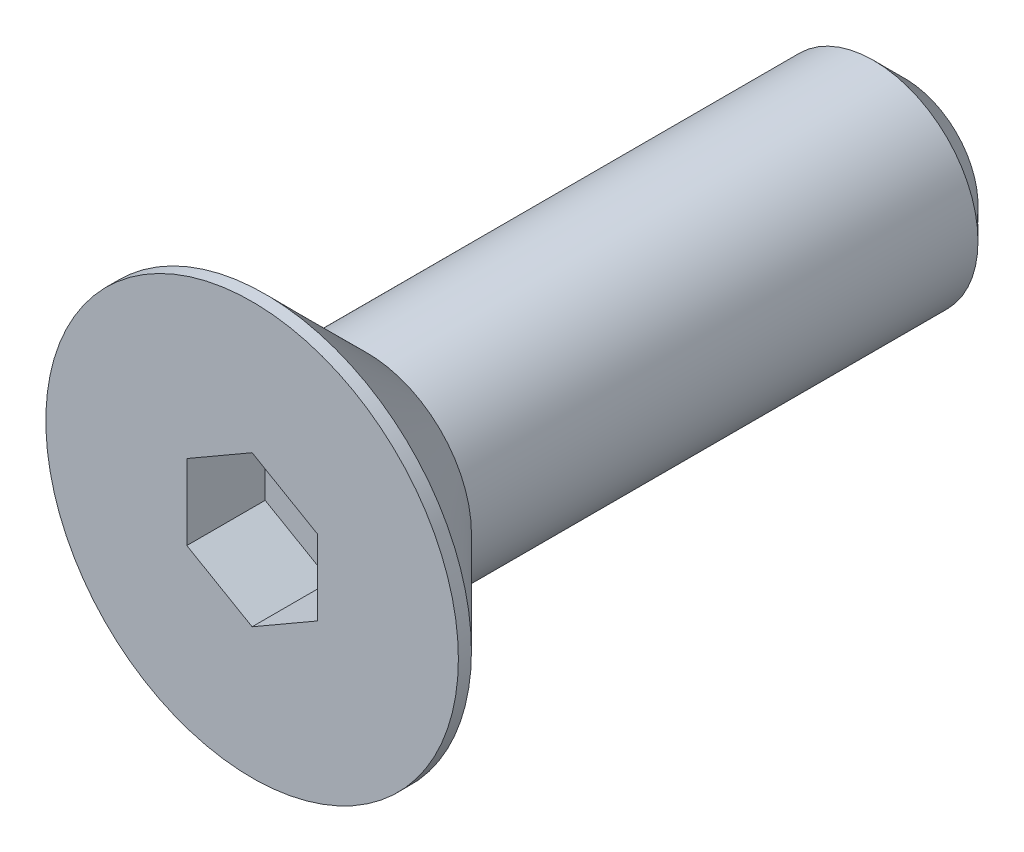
ISO-10303-21;
HEADER;
FILE_DESCRIPTION(('STEP AP214'),'2;1');
FILE_NAME('part.step','',(''),(''),'','','');
FILE_SCHEMA(('AUTOMOTIVE_DESIGN { 1 0 10303 214 1 1 1 1 }'));
ENDSEC;
DATA;
#1=APPLICATION_CONTEXT('core data for automotive mechanical design processes');
#2=APPLICATION_PROTOCOL_DEFINITION('international standard','automotive_design',2000,#1);
#3=PRODUCT_CONTEXT('',#1,'mechanical');
#4=PRODUCT('Part','Part','',(#3));
#5=PRODUCT_RELATED_PRODUCT_CATEGORY('part','',(#4));
#6=PRODUCT_DEFINITION_FORMATION('','',#4);
#7=PRODUCT_DEFINITION_CONTEXT('part definition',#1,'design');
#8=PRODUCT_DEFINITION('design','',#6,#7);
#9=PRODUCT_DEFINITION_SHAPE('','',#8);
#10=(LENGTH_UNIT() NAMED_UNIT(*) SI_UNIT(.MILLI.,.METRE.));
#11=(NAMED_UNIT(*) PLANE_ANGLE_UNIT() SI_UNIT($,.RADIAN.));
#12=(NAMED_UNIT(*) SI_UNIT($,.STERADIAN.) SOLID_ANGLE_UNIT());
#13=UNCERTAINTY_MEASURE_WITH_UNIT(LENGTH_MEASURE(1.E-05),#10,'distance_accuracy_value','');
#14=(GEOMETRIC_REPRESENTATION_CONTEXT(3) GLOBAL_UNCERTAINTY_ASSIGNED_CONTEXT((#13)) GLOBAL_UNIT_ASSIGNED_CONTEXT((#10,
#11,#12)) REPRESENTATION_CONTEXT('',''));
#15=CARTESIAN_POINT('',(0.,0.,0.));
#16=DIRECTION('',(0.,0.,1.));
#17=DIRECTION('',(1.,0.,0.));
#18=AXIS2_PLACEMENT_3D('',#15,#16,#17);
#19=CARTESIAN_POINT('',(0.,0.,0.));
#20=DIRECTION('',(0.,0.,1.));
#21=DIRECTION('',(1.,0.,0.));
#22=AXIS2_PLACEMENT_3D('',#19,#20,#21);
#23=PLANE('',#22);
#24=DIRECTION('',(-0.866025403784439,0.5,0.));
#25=VECTOR('',#24,1.);
#26=CARTESIAN_POINT('',(2.5,1.44337567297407,0.));
#27=LINE('',#26,#25);
#28=CARTESIAN_POINT('',(2.5,1.44337567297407,0.));
#29=VERTEX_POINT('',#28);
#30=CARTESIAN_POINT('',(0.,2.88675134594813,0.));
#31=VERTEX_POINT('',#30);
#32=EDGE_CURVE('E29',#29,#31,#27,.T.);
#33=ORIENTED_EDGE('',*,*,#32,.F.);
#34=DIRECTION('',(0.,1.,0.));
#35=VECTOR('',#34,1.);
#36=CARTESIAN_POINT('',(2.5,-1.44337567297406,0.));
#37=LINE('',#36,#35);
#38=CARTESIAN_POINT('',(2.5,-1.44337567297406,0.));
#39=VERTEX_POINT('',#38);
#40=EDGE_CURVE('E112',#39,#29,#37,.T.);
#41=ORIENTED_EDGE('',*,*,#40,.F.);
#42=DIRECTION('',(0.866025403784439,0.5,0.));
#43=VECTOR('',#42,1.);
#44=CARTESIAN_POINT('',(0.,-2.88675134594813,0.));
#45=LINE('',#44,#43);
#46=CARTESIAN_POINT('',(0.,-2.88675134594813,0.));
#47=VERTEX_POINT('',#46);
#48=EDGE_CURVE('E110',#47,#39,#45,.T.);
#49=ORIENTED_EDGE('',*,*,#48,.F.);
#50=DIRECTION('',(0.866025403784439,-0.5,0.));
#51=VECTOR('',#50,1.);
#52=CARTESIAN_POINT('',(-2.5,-1.44337567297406,0.));
#53=LINE('',#52,#51);
#54=CARTESIAN_POINT('',(-2.5,-1.44337567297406,0.));
#55=VERTEX_POINT('',#54);
#56=EDGE_CURVE('E77',#55,#47,#53,.T.);
#57=ORIENTED_EDGE('',*,*,#56,.F.);
#58=DIRECTION('',(0.,-1.,0.));
#59=VECTOR('',#58,1.);
#60=CARTESIAN_POINT('',(-2.5,1.44337567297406,0.));
#61=LINE('',#60,#59);
#62=CARTESIAN_POINT('',(-2.5,1.44337567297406,0.));
#63=VERTEX_POINT('',#62);
#64=EDGE_CURVE('E106',#63,#55,#61,.T.);
#65=ORIENTED_EDGE('',*,*,#64,.F.);
#66=DIRECTION('',(-0.866025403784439,-0.5,0.));
#67=VECTOR('',#66,1.);
#68=CARTESIAN_POINT('',(0.,2.88675134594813,0.));
#69=LINE('',#68,#67);
#70=EDGE_CURVE('E103',#31,#63,#69,.T.);
#71=ORIENTED_EDGE('',*,*,#70,.F.);
#72=EDGE_LOOP('',(#33,#41,#49,#57,#65,#71));
#73=FACE_BOUND('',#72,.T.);
#74=CARTESIAN_POINT('',(0.,0.,0.));
#75=DIRECTION('',(0.,0.,1.));
#76=DIRECTION('',(1.,0.,0.));
#77=AXIS2_PLACEMENT_3D('',#74,#75,#76);
#78=CIRCLE('',#77,7.9);
#79=CARTESIAN_POINT('',(7.9,0.,0.));
#80=VERTEX_POINT('',#79);
#81=EDGE_CURVE('E127',#80,#80,#78,.T.);
#82=ORIENTED_EDGE('',*,*,#81,.T.);
#83=EDGE_LOOP('',(#82));
#84=FACE_BOUND('',#83,.T.);
#85=ADVANCED_FACE('F14',(#73,#84),#23,.T.);
#86=CARTESIAN_POINT('',(0.,0.,0.));
#87=DIRECTION('',(0.,0.,1.));
#88=DIRECTION('',(1.,0.,0.));
#89=AXIS2_PLACEMENT_3D('',#86,#87,#88);
#90=CYLINDRICAL_SURFACE('',#89,7.9);
#91=CARTESIAN_POINT('',(0.,0.,-0.499999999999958));
#92=DIRECTION('',(0.,0.,1.));
#93=DIRECTION('',(1.,0.,0.));
#94=AXIS2_PLACEMENT_3D('',#91,#92,#93);
#95=CIRCLE('',#94,7.9);
#96=CARTESIAN_POINT('',(7.9,0.,-0.499999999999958));
#97=VERTEX_POINT('',#96);
#98=EDGE_CURVE('E124',#97,#97,#95,.T.);
#99=ORIENTED_EDGE('',*,*,#98,.T.);
#100=EDGE_LOOP('',(#99));
#101=FACE_BOUND('',#100,.T.);
#102=ORIENTED_EDGE('',*,*,#81,.F.);
#103=EDGE_LOOP('',(#102));
#104=FACE_BOUND('',#103,.T.);
#105=ADVANCED_FACE('F151',(#101,#104),#90,.T.);
#106=CARTESIAN_POINT('',(0.,0.,-0.499999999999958));
#107=DIRECTION('',(0.,0.,1.));
#108=DIRECTION('',(1.,0.,0.));
#109=AXIS2_PLACEMENT_3D('',#106,#107,#108);
#110=CONICAL_SURFACE('',#109,7.9,0.785398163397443);
#111=CARTESIAN_POINT('',(0.,0.,-4.4));
#112=DIRECTION('',(0.,0.,1.));
#113=DIRECTION('',(1.,0.,0.));
#114=AXIS2_PLACEMENT_3D('',#111,#112,#113);
#115=CIRCLE('',#114,4.);
#116=CARTESIAN_POINT('',(4.,0.,-4.4));
#117=VERTEX_POINT('',#116);
#118=EDGE_CURVE('E116',#117,#117,#115,.T.);
#119=ORIENTED_EDGE('',*,*,#118,.T.);
#120=EDGE_LOOP('',(#119));
#121=FACE_BOUND('',#120,.T.);
#122=ORIENTED_EDGE('',*,*,#98,.F.);
#123=EDGE_LOOP('',(#122));
#124=FACE_BOUND('',#123,.T.);
#125=ADVANCED_FACE('F157',(#121,#124),#110,.T.);
#126=CARTESIAN_POINT('',(0.,0.,0.));
#127=DIRECTION('',(0.,0.,1.));
#128=DIRECTION('',(1.,0.,0.));
#129=AXIS2_PLACEMENT_3D('',#126,#127,#128);
#130=CYLINDRICAL_SURFACE('',#129,4.);
#131=CARTESIAN_POINT('',(0.,0.,-23.8));
#132=DIRECTION('',(0.,0.,-1.));
#133=DIRECTION('',(-1.,0.,0.));
#134=AXIS2_PLACEMENT_3D('',#131,#132,#133);
#135=CIRCLE('',#134,4.);
#136=CARTESIAN_POINT('',(-4.,0.,-23.8));
#137=VERTEX_POINT('',#136);
#138=EDGE_CURVE('E22',#137,#137,#135,.F.);
#139=ORIENTED_EDGE('',*,*,#138,.T.);
#140=EDGE_LOOP('',(#139));
#141=FACE_BOUND('',#140,.T.);
#142=ORIENTED_EDGE('',*,*,#118,.F.);
#143=EDGE_LOOP('',(#142));
#144=FACE_BOUND('',#143,.T.);
#145=ADVANCED_FACE('F132',(#141,#144),#130,.T.);
#146=CARTESIAN_POINT('',(4.,0.,-25.));
#147=DIRECTION('',(0.,0.,-1.));
#148=DIRECTION('',(-1.,0.,0.));
#149=AXIS2_PLACEMENT_3D('',#146,#147,#148);
#150=PLANE('',#149);
#151=CARTESIAN_POINT('',(0.,0.,-25.));
#152=DIRECTION('',(0.,0.,-1.));
#153=DIRECTION('',(-1.,0.,0.));
#154=AXIS2_PLACEMENT_3D('',#151,#152,#153);
#155=CIRCLE('',#154,2.8);
#156=CARTESIAN_POINT('',(-2.8,0.,-25.));
#157=VERTEX_POINT('',#156);
#158=EDGE_CURVE('E9',#157,#157,#155,.T.);
#159=ORIENTED_EDGE('',*,*,#158,.T.);
#160=EDGE_LOOP('',(#159));
#161=FACE_BOUND('',#160,.T.);
#162=ADVANCED_FACE('F137',(#161),#150,.T.);
#163=CARTESIAN_POINT('',(0.,0.,-23.8));
#164=DIRECTION('',(0.,0.,1.));
#165=DIRECTION('',(1.,0.,0.));
#166=AXIS2_PLACEMENT_3D('',#163,#164,#165);
#167=CONICAL_SURFACE('',#166,4.,0.785398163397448);
#168=ORIENTED_EDGE('',*,*,#158,.F.);
#169=EDGE_LOOP('',(#168));
#170=FACE_BOUND('',#169,.T.);
#171=ORIENTED_EDGE('',*,*,#138,.F.);
#172=EDGE_LOOP('',(#171));
#173=FACE_BOUND('',#172,.T.);
#174=ADVANCED_FACE('F16',(#170,#173),#167,.T.);
#175=CARTESIAN_POINT('',(2.5,1.44337567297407,-3.));
#176=DIRECTION('',(0.5,0.866025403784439,0.));
#177=DIRECTION('',(-0.866025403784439,0.5,0.));
#178=AXIS2_PLACEMENT_3D('',#175,#176,#177);
#179=PLANE('',#178);
#180=ORIENTED_EDGE('',*,*,#32,.T.);
#181=DIRECTION('',(0.,0.,1.));
#182=VECTOR('',#181,1.);
#183=CARTESIAN_POINT('',(0.,2.88675134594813,-3.));
#184=LINE('',#183,#182);
#185=CARTESIAN_POINT('',(0.,2.88675134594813,-3.));
#186=VERTEX_POINT('',#185);
#187=EDGE_CURVE('E59',#186,#31,#184,.T.);
#188=ORIENTED_EDGE('',*,*,#187,.F.);
#189=DIRECTION('',(-0.866025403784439,0.5,0.));
#190=VECTOR('',#189,1.);
#191=CARTESIAN_POINT('',(2.5,1.44337567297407,-3.));
#192=LINE('',#191,#190);
#193=CARTESIAN_POINT('',(2.5,1.44337567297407,-3.));
#194=VERTEX_POINT('',#193);
#195=EDGE_CURVE('E114',#194,#186,#192,.T.);
#196=ORIENTED_EDGE('',*,*,#195,.F.);
#197=DIRECTION('',(0.,0.,1.));
#198=VECTOR('',#197,1.);
#199=CARTESIAN_POINT('',(2.5,1.44337567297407,-3.));
#200=LINE('',#199,#198);
#201=EDGE_CURVE('E37',#194,#29,#200,.T.);
#202=ORIENTED_EDGE('',*,*,#201,.T.);
#203=EDGE_LOOP('',(#180,#188,#196,#202));
#204=FACE_BOUND('',#203,.T.);
#205=ADVANCED_FACE('F136',(#204),#179,.F.);
#206=CARTESIAN_POINT('',(2.5,-1.44337567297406,-3.));
#207=DIRECTION('',(1.,0.,0.));
#208=DIRECTION('',(0.,0.,-1.));
#209=AXIS2_PLACEMENT_3D('',#206,#207,#208);
#210=PLANE('',#209);
#211=ORIENTED_EDGE('',*,*,#40,.T.);
#212=ORIENTED_EDGE('',*,*,#201,.F.);
#213=DIRECTION('',(0.,1.,0.));
#214=VECTOR('',#213,1.);
#215=CARTESIAN_POINT('',(2.5,-1.44337567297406,-3.));
#216=LINE('',#215,#214);
#217=CARTESIAN_POINT('',(2.5,-1.44337567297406,-3.));
#218=VERTEX_POINT('',#217);
#219=EDGE_CURVE('E89',#218,#194,#216,.T.);
#220=ORIENTED_EDGE('',*,*,#219,.F.);
#221=DIRECTION('',(0.,0.,1.));
#222=VECTOR('',#221,1.);
#223=CARTESIAN_POINT('',(2.5,-1.44337567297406,-3.));
#224=LINE('',#223,#222);
#225=EDGE_CURVE('E81',#218,#39,#224,.T.);
#226=ORIENTED_EDGE('',*,*,#225,.T.);
#227=EDGE_LOOP('',(#211,#212,#220,#226));
#228=FACE_BOUND('',#227,.T.);
#229=ADVANCED_FACE('F145',(#228),#210,.F.);
#230=CARTESIAN_POINT('',(0.,-2.88675134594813,-3.));
#231=DIRECTION('',(0.5,-0.866025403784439,0.));
#232=DIRECTION('',(0.866025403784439,0.5,0.));
#233=AXIS2_PLACEMENT_3D('',#230,#231,#232);
#234=PLANE('',#233);
#235=ORIENTED_EDGE('',*,*,#48,.T.);
#236=ORIENTED_EDGE('',*,*,#225,.F.);
#237=DIRECTION('',(0.866025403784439,0.5,0.));
#238=VECTOR('',#237,1.);
#239=CARTESIAN_POINT('',(0.,-2.88675134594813,-3.));
#240=LINE('',#239,#238);
#241=CARTESIAN_POINT('',(0.,-2.88675134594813,-3.));
#242=VERTEX_POINT('',#241);
#243=EDGE_CURVE('E85',#242,#218,#240,.T.);
#244=ORIENTED_EDGE('',*,*,#243,.F.);
#245=DIRECTION('',(0.,0.,1.));
#246=VECTOR('',#245,1.);
#247=CARTESIAN_POINT('',(0.,-2.88675134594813,-3.));
#248=LINE('',#247,#246);
#249=EDGE_CURVE('E70',#242,#47,#248,.T.);
#250=ORIENTED_EDGE('',*,*,#249,.T.);
#251=EDGE_LOOP('',(#235,#236,#244,#250));
#252=FACE_BOUND('',#251,.T.);
#253=ADVANCED_FACE('F86',(#252),#234,.F.);
#254=CARTESIAN_POINT('',(-2.5,-1.44337567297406,-3.));
#255=DIRECTION('',(-0.5,-0.866025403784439,0.));
#256=DIRECTION('',(0.866025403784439,-0.5,0.));
#257=AXIS2_PLACEMENT_3D('',#254,#255,#256);
#258=PLANE('',#257);
#259=ORIENTED_EDGE('',*,*,#56,.T.);
#260=ORIENTED_EDGE('',*,*,#249,.F.);
#261=DIRECTION('',(0.866025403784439,-0.5,0.));
#262=VECTOR('',#261,1.);
#263=CARTESIAN_POINT('',(-2.5,-1.44337567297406,-3.));
#264=LINE('',#263,#262);
#265=CARTESIAN_POINT('',(-2.5,-1.44337567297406,-3.));
#266=VERTEX_POINT('',#265);
#267=EDGE_CURVE('E74',#266,#242,#264,.T.);
#268=ORIENTED_EDGE('',*,*,#267,.F.);
#269=DIRECTION('',(0.,0.,1.));
#270=VECTOR('',#269,1.);
#271=CARTESIAN_POINT('',(-2.5,-1.44337567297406,-3.));
#272=LINE('',#271,#270);
#273=EDGE_CURVE('E82',#266,#55,#272,.T.);
#274=ORIENTED_EDGE('',*,*,#273,.T.);
#275=EDGE_LOOP('',(#259,#260,#268,#274));
#276=FACE_BOUND('',#275,.T.);
#277=ADVANCED_FACE('F72',(#276),#258,.F.);
#278=CARTESIAN_POINT('',(-2.5,1.44337567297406,-3.));
#279=DIRECTION('',(-1.,0.,0.));
#280=DIRECTION('',(0.,0.,1.));
#281=AXIS2_PLACEMENT_3D('',#278,#279,#280);
#282=PLANE('',#281);
#283=ORIENTED_EDGE('',*,*,#64,.T.);
#284=ORIENTED_EDGE('',*,*,#273,.F.);
#285=DIRECTION('',(0.,-1.,0.));
#286=VECTOR('',#285,1.);
#287=CARTESIAN_POINT('',(-2.5,1.44337567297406,-3.));
#288=LINE('',#287,#286);
#289=CARTESIAN_POINT('',(-2.5,1.44337567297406,-3.));
#290=VERTEX_POINT('',#289);
#291=EDGE_CURVE('E95',#290,#266,#288,.T.);
#292=ORIENTED_EDGE('',*,*,#291,.F.);
#293=DIRECTION('',(0.,0.,1.));
#294=VECTOR('',#293,1.);
#295=CARTESIAN_POINT('',(-2.5,1.44337567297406,-3.));
#296=LINE('',#295,#294);
#297=EDGE_CURVE('E119',#290,#63,#296,.T.);
#298=ORIENTED_EDGE('',*,*,#297,.T.);
#299=EDGE_LOOP('',(#283,#284,#292,#298));
#300=FACE_BOUND('',#299,.T.);
#301=ADVANCED_FACE('F170',(#300),#282,.F.);
#302=CARTESIAN_POINT('',(0.,2.88675134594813,-3.));
#303=DIRECTION('',(-0.5,0.866025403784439,0.));
#304=DIRECTION('',(-0.866025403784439,-0.5,0.));
#305=AXIS2_PLACEMENT_3D('',#302,#303,#304);
#306=PLANE('',#305);
#307=ORIENTED_EDGE('',*,*,#70,.T.);
#308=ORIENTED_EDGE('',*,*,#297,.F.);
#309=DIRECTION('',(-0.866025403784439,-0.5,0.));
#310=VECTOR('',#309,1.);
#311=CARTESIAN_POINT('',(0.,2.88675134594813,-3.));
#312=LINE('',#311,#310);
#313=EDGE_CURVE('E97',#186,#290,#312,.T.);
#314=ORIENTED_EDGE('',*,*,#313,.F.);
#315=ORIENTED_EDGE('',*,*,#187,.T.);
#316=EDGE_LOOP('',(#307,#308,#314,#315));
#317=FACE_BOUND('',#316,.T.);
#318=ADVANCED_FACE('F167',(#317),#306,.F.);
#319=CARTESIAN_POINT('',(0.,2.88675134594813,-3.));
#320=DIRECTION('',(0.,0.,1.));
#321=DIRECTION('',(1.,0.,0.));
#322=AXIS2_PLACEMENT_3D('',#319,#320,#321);
#323=PLANE('',#322);
#324=ORIENTED_EDGE('',*,*,#195,.T.);
#325=ORIENTED_EDGE('',*,*,#313,.T.);
#326=ORIENTED_EDGE('',*,*,#291,.T.);
#327=ORIENTED_EDGE('',*,*,#267,.T.);
#328=ORIENTED_EDGE('',*,*,#243,.T.);
#329=ORIENTED_EDGE('',*,*,#219,.T.);
#330=EDGE_LOOP('',(#324,#325,#326,#327,#328,#329));
#331=FACE_BOUND('',#330,.T.);
#332=ADVANCED_FACE('F92',(#331),#323,.T.);
#333=CLOSED_SHELL('',(#85,#105,#125,#145,#162,#174,#205,#229,#253,#277,#301,#318,#332));
#334=MANIFOLD_SOLID_BREP('B1',#333);
#335=ADVANCED_BREP_SHAPE_REPRESENTATION('',(#18,#334),#14);
#336=SHAPE_DEFINITION_REPRESENTATION(#9,#335);
ENDSEC;
END-ISO-10303-21;
